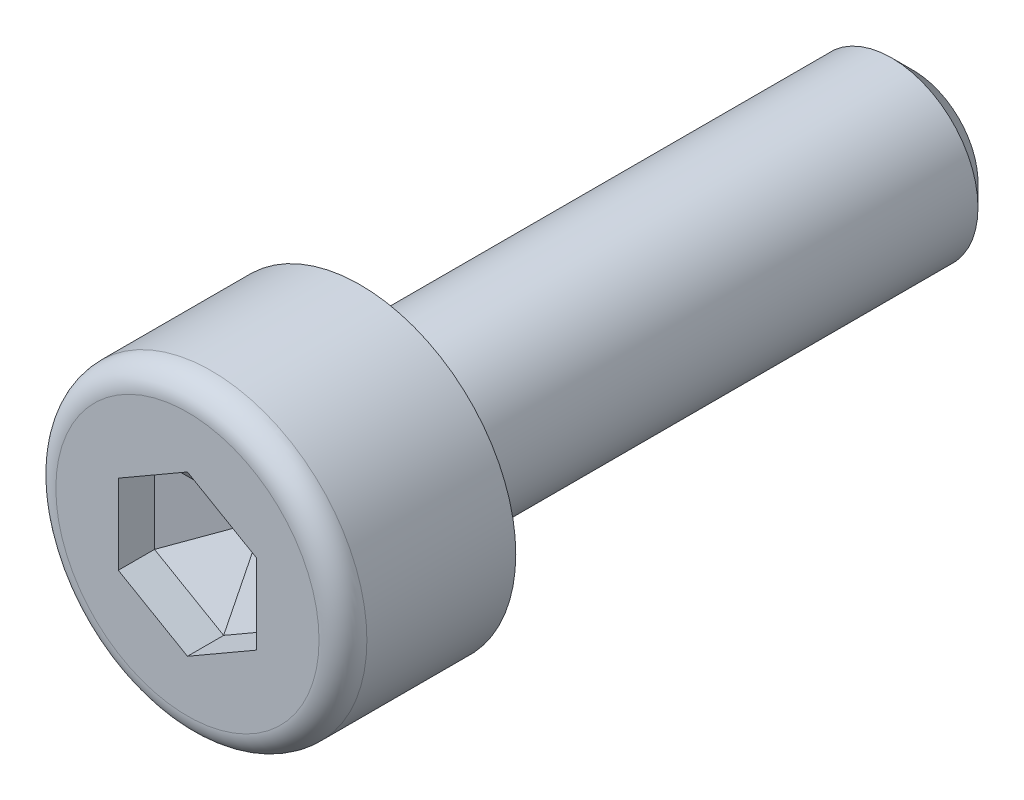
from build123d import *
from OCP.BRepFilletAPI import BRepFilletAPI_MakeChamfer

# Parameters (mm, degrees)
SKETCH_1_R          = 2.25
EXTRUDE_1_DEPTH     = 2.5
CUT_EXTRUDE_1_DEPTH = 1.1
SKETCH_3_R          = 1.25
EXTRUDE_2_DEPTH     = 8
CHAMFER_1_SIZE      = 0.3125
FILLET_1_R          = 0.346153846
CHAMFER_2_SIZE      = 0.576368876
CHAMFER_2_SIZE2     = 0.998300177
FILLET_2_R          = 0.1


with BuildPart() as part:
    # Sketch 1 → Extrude 1 (new body)
    with BuildSketch(Plane.XY):
        Circle(SKETCH_1_R)
    extrude(amount=EXTRUDE_1_DEPTH)

    # Sketch 2 → Cut-Extrude 1 (cut)
    with BuildSketch(Plane.XY.offset(2.5)):
        Polygon((1, 0.577350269), (0, 1.154700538), (-1, 0.577350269), (-1, -0.577350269), (0, -1.154700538), (1, -0.577350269), align=None)
    extrude(amount=-CUT_EXTRUDE_1_DEPTH, mode=Mode.SUBTRACT)

    # Sketch 3 → Extrude 2 (add)
    with BuildSketch(Plane(origin=(0, 0, 0), x_dir=(-1, 0, 0), z_dir=(0, 0, -1))):
        with Locations(Location((0, 0, 0), (0, 0, 180))):
            Circle(SKETCH_3_R)
    extrude(amount=EXTRUDE_2_DEPTH)

    # Chamfer 1
    chamfer_1_edges = [part.edges().sort_by_distance(p)[0] for p in [
        (-1.25, 0, -8),
    ]]
    chamfer(chamfer_1_edges, length=CHAMFER_1_SIZE)

    # Fillet 1
    fillet_1_edges = [part.edges().sort_by_distance(p)[0] for p in [
        (-2.25, 0, 2.5),
    ]]
    fillet(fillet_1_edges, radius=FILLET_1_R)

    # Chamfer 2: one chamfer whose edges measure the first distance from different faces: ONE call of the kernel's chamfer builder (chamfer() names one face for all edges)
    chamfer_2_edges_1 = [part.edges().sort_by_distance(p)[0] for p in [
        (-0.5, 0.866025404, 1.4),
    ]]
    chamfer_2_side_1 = [part.faces().sort_by_distance(p)[0] for p in [
        (-0.5, 0.866025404, 1.95),
    ]]
    chamfer_2_edges_2 = [part.edges().sort_by_distance(p)[0] for p in [
        (0.5, 0.866025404, 1.4),
    ]]
    chamfer_2_side_2 = [part.faces().sort_by_distance(p)[0] for p in [
        (0.5, 0.866025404, 1.95),
    ]]
    chamfer_2_edges_3 = [part.edges().sort_by_distance(p)[0] for p in [
        (1, 0, 1.4),
    ]]
    chamfer_2_side_3 = [part.faces().sort_by_distance(p)[0] for p in [
        (1, 0, 1.95),
    ]]
    chamfer_2_edges_4 = [part.edges().sort_by_distance(p)[0] for p in [
        (0.5, -0.866025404, 1.4),
    ]]
    chamfer_2_side_4 = [part.faces().sort_by_distance(p)[0] for p in [
        (0.5, -0.866025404, 1.95),
    ]]
    chamfer_2_edges_5 = [part.edges().sort_by_distance(p)[0] for p in [
        (-0.5, -0.866025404, 1.4),
    ]]
    chamfer_2_side_5 = [part.faces().sort_by_distance(p)[0] for p in [
        (-0.5, -0.866025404, 1.95),
    ]]
    chamfer_2_edges_6 = [part.edges().sort_by_distance(p)[0] for p in [
        (-1, 0, 1.4),
    ]]
    chamfer_2_side_6 = [part.faces().sort_by_distance(p)[0] for p in [
        (-1, 0, 1.95),
    ]]
    chamfer_2 = BRepFilletAPI_MakeChamfer(part.part.solid().wrapped)
    for e in chamfer_2_edges_1:
        chamfer_2.Add(CHAMFER_2_SIZE, CHAMFER_2_SIZE2, e.wrapped, chamfer_2_side_1[0].wrapped)  # the first distance lies on this face
    for e in chamfer_2_edges_2:
        chamfer_2.Add(CHAMFER_2_SIZE, CHAMFER_2_SIZE2, e.wrapped, chamfer_2_side_2[0].wrapped)  # the first distance lies on this face
    for e in chamfer_2_edges_3:
        chamfer_2.Add(CHAMFER_2_SIZE, CHAMFER_2_SIZE2, e.wrapped, chamfer_2_side_3[0].wrapped)  # the first distance lies on this face
    for e in chamfer_2_edges_4:
        chamfer_2.Add(CHAMFER_2_SIZE, CHAMFER_2_SIZE2, e.wrapped, chamfer_2_side_4[0].wrapped)  # the first distance lies on this face
    for e in chamfer_2_edges_5:
        chamfer_2.Add(CHAMFER_2_SIZE, CHAMFER_2_SIZE2, e.wrapped, chamfer_2_side_5[0].wrapped)  # the first distance lies on this face
    for e in chamfer_2_edges_6:
        chamfer_2.Add(CHAMFER_2_SIZE, CHAMFER_2_SIZE2, e.wrapped, chamfer_2_side_6[0].wrapped)  # the first distance lies on this face
    add(Compound.cast(chamfer_2.Shape()), mode=Mode.REPLACE)

    # Fillet 2
    fillet_2_edges = [part.edges().sort_by_distance(p)[0] for p in [
        (-1.25, 0, 0),
    ]]
    fillet(fillet_2_edges, radius=FILLET_2_R)


solid = part.part
